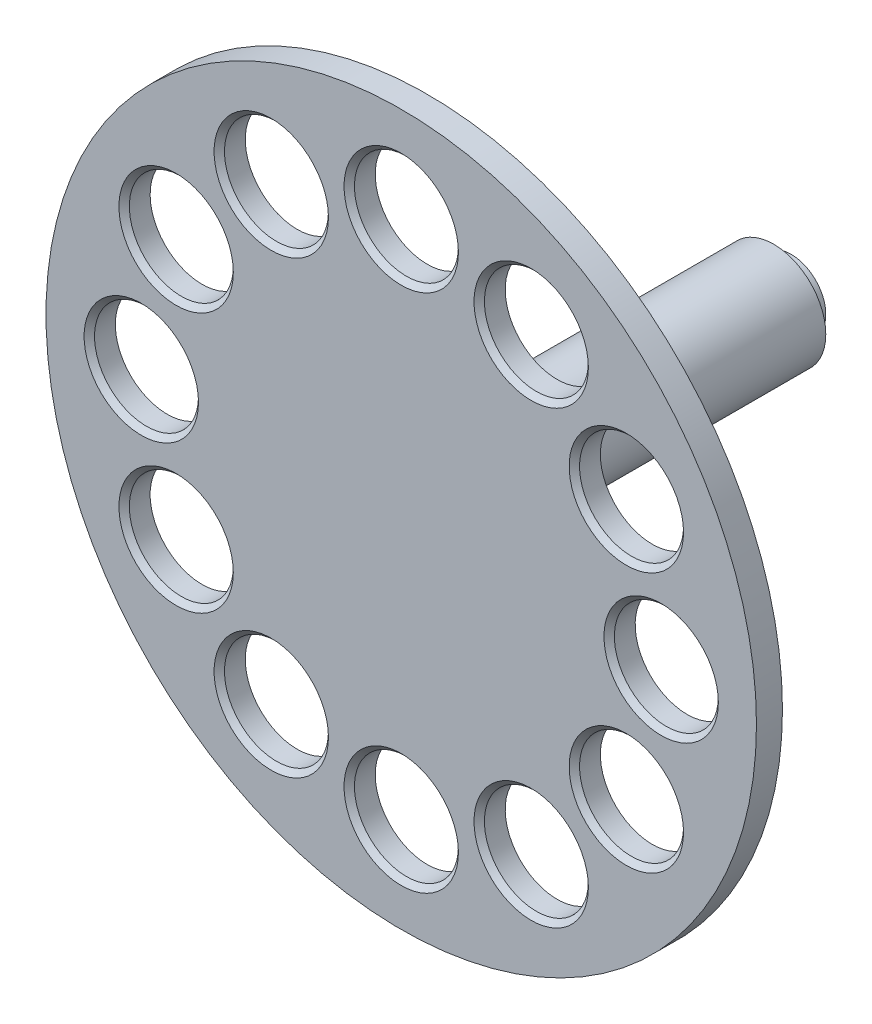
ISO-10303-21;
HEADER;
FILE_DESCRIPTION(('STEP AP214'),'2;1');
FILE_NAME('part.step','',(''),(''),'','','');
FILE_SCHEMA(('AUTOMOTIVE_DESIGN { 1 0 10303 214 1 1 1 1 }'));
ENDSEC;
DATA;
#1=APPLICATION_CONTEXT('core data for automotive mechanical design processes');
#2=APPLICATION_PROTOCOL_DEFINITION('international standard','automotive_design',2000,#1);
#3=PRODUCT_CONTEXT('',#1,'mechanical');
#4=PRODUCT('Part','Part','',(#3));
#5=PRODUCT_RELATED_PRODUCT_CATEGORY('part','',(#4));
#6=PRODUCT_DEFINITION_FORMATION('','',#4);
#7=PRODUCT_DEFINITION_CONTEXT('part definition',#1,'design');
#8=PRODUCT_DEFINITION('design','',#6,#7);
#9=PRODUCT_DEFINITION_SHAPE('','',#8);
#10=(LENGTH_UNIT() NAMED_UNIT(*) SI_UNIT(.MILLI.,.METRE.));
#11=(NAMED_UNIT(*) PLANE_ANGLE_UNIT() SI_UNIT($,.RADIAN.));
#12=(NAMED_UNIT(*) SI_UNIT($,.STERADIAN.) SOLID_ANGLE_UNIT());
#13=UNCERTAINTY_MEASURE_WITH_UNIT(LENGTH_MEASURE(1.E-05),#10,'distance_accuracy_value','');
#14=(GEOMETRIC_REPRESENTATION_CONTEXT(3) GLOBAL_UNCERTAINTY_ASSIGNED_CONTEXT((#13)) GLOBAL_UNIT_ASSIGNED_CONTEXT((#10,
#11,#12)) REPRESENTATION_CONTEXT('',''));
#15=CARTESIAN_POINT('',(0.,0.,0.));
#16=DIRECTION('',(0.,0.,1.));
#17=DIRECTION('',(1.,0.,0.));
#18=AXIS2_PLACEMENT_3D('',#15,#16,#17);
#19=CARTESIAN_POINT('',(0.,0.,-200.));
#20=DIRECTION('',(0.,0.,-1.));
#21=DIRECTION('',(-1.,0.,0.));
#22=AXIS2_PLACEMENT_3D('',#19,#20,#21);
#23=PLANE('',#22);
#24=CARTESIAN_POINT('',(0.,0.,-200.));
#25=DIRECTION('',(0.,0.,-1.));
#26=DIRECTION('',(-1.,0.,0.));
#27=AXIS2_PLACEMENT_3D('',#24,#25,#26);
#28=CIRCLE('',#27,30.);
#29=CARTESIAN_POINT('',(-30.,0.,-200.));
#30=VERTEX_POINT('',#29);
#31=EDGE_CURVE('E152',#30,#30,#28,.T.);
#32=ORIENTED_EDGE('',*,*,#31,.T.);
#33=EDGE_LOOP('',(#32));
#34=FACE_BOUND('',#33,.T.);
#35=CARTESIAN_POINT('',(0.,0.,-200.));
#36=DIRECTION('',(0.,0.,-1.));
#37=DIRECTION('',(-1.,0.,0.));
#38=AXIS2_PLACEMENT_3D('',#35,#36,#37);
#39=CIRCLE('',#38,20.);
#40=CARTESIAN_POINT('',(-20.,0.,-200.));
#41=VERTEX_POINT('',#40);
#42=EDGE_CURVE('E158',#41,#41,#39,.T.);
#43=ORIENTED_EDGE('',*,*,#42,.F.);
#44=EDGE_LOOP('',(#43));
#45=FACE_BOUND('',#44,.T.);
#46=ADVANCED_FACE('F26',(#34,#45),#23,.T.);
#47=CARTESIAN_POINT('',(0.,0.,0.));
#48=DIRECTION('',(0.,0.,1.));
#49=DIRECTION('',(1.,0.,0.));
#50=AXIS2_PLACEMENT_3D('',#47,#48,#49);
#51=PLANE('',#50);
#52=CARTESIAN_POINT('',(0.,0.,0.));
#53=DIRECTION('',(0.,0.,1.));
#54=DIRECTION('',(1.,0.,0.));
#55=AXIS2_PLACEMENT_3D('',#52,#53,#54);
#56=CIRCLE('',#55,205.);
#57=CARTESIAN_POINT('',(205.,0.,0.));
#58=VERTEX_POINT('',#57);
#59=EDGE_CURVE('E113',#58,#58,#56,.T.);
#60=ORIENTED_EDGE('',*,*,#59,.F.);
#61=EDGE_LOOP('',(#60));
#62=FACE_BOUND('',#61,.T.);
#63=CARTESIAN_POINT('',(0.,150.,0.));
#64=DIRECTION('',(0.,0.,1.));
#65=DIRECTION('',(1.,0.,0.));
#66=AXIS2_PLACEMENT_3D('',#63,#64,#65);
#67=CIRCLE('',#66,30.);
#68=CARTESIAN_POINT('',(30.,150.,0.));
#69=VERTEX_POINT('',#68);
#70=EDGE_CURVE('E116',#69,#69,#67,.T.);
#71=ORIENTED_EDGE('',*,*,#70,.T.);
#72=EDGE_LOOP('',(#71));
#73=FACE_BOUND('',#72,.T.);
#74=CARTESIAN_POINT('',(75.0000000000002,129.903810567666,0.));
#75=DIRECTION('',(0.,0.,1.));
#76=DIRECTION('',(0.866025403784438,-0.500000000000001,0.));
#77=AXIS2_PLACEMENT_3D('',#74,#75,#76);
#78=CIRCLE('',#77,30.);
#79=CARTESIAN_POINT('',(100.980762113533,114.903810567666,0.));
#80=VERTEX_POINT('',#79);
#81=EDGE_CURVE('E119',#80,#80,#78,.T.);
#82=ORIENTED_EDGE('',*,*,#81,.T.);
#83=EDGE_LOOP('',(#82));
#84=FACE_BOUND('',#83,.T.);
#85=CARTESIAN_POINT('',(129.903810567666,74.9999999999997,0.));
#86=DIRECTION('',(0.,0.,1.));
#87=DIRECTION('',(0.499999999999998,-0.86602540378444,0.));
#88=AXIS2_PLACEMENT_3D('',#85,#86,#87);
#89=CIRCLE('',#88,30.);
#90=CARTESIAN_POINT('',(144.903810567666,49.0192378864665,0.));
#91=VERTEX_POINT('',#90);
#92=EDGE_CURVE('E122',#91,#91,#89,.T.);
#93=ORIENTED_EDGE('',*,*,#92,.T.);
#94=EDGE_LOOP('',(#93));
#95=FACE_BOUND('',#94,.T.);
#96=CARTESIAN_POINT('',(150.,-5.23722504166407E-13,0.));
#97=DIRECTION('',(0.,0.,1.));
#98=DIRECTION('',(0.,-1.,0.));
#99=AXIS2_PLACEMENT_3D('',#96,#97,#98);
#100=CIRCLE('',#99,30.);
#101=CARTESIAN_POINT('',(150.,-30.0000000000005,0.));
#102=VERTEX_POINT('',#101);
#103=EDGE_CURVE('E125',#102,#102,#100,.T.);
#104=ORIENTED_EDGE('',*,*,#103,.T.);
#105=EDGE_LOOP('',(#104));
#106=FACE_BOUND('',#105,.T.);
#107=CARTESIAN_POINT('',(129.903810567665,-75.0000000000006,0.));
#108=DIRECTION('',(0.,0.,1.));
#109=DIRECTION('',(-0.500000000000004,-0.866025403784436,0.));
#110=AXIS2_PLACEMENT_3D('',#107,#108,#109);
#111=CIRCLE('',#110,30.);
#112=CARTESIAN_POINT('',(114.903810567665,-100.980762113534,0.));
#113=VERTEX_POINT('',#112);
#114=EDGE_CURVE('E128',#113,#113,#111,.T.);
#115=ORIENTED_EDGE('',*,*,#114,.T.);
#116=EDGE_LOOP('',(#115));
#117=FACE_BOUND('',#116,.T.);
#118=CARTESIAN_POINT('',(74.9999999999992,-129.903810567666,0.));
#119=DIRECTION('',(0.,0.,1.));
#120=DIRECTION('',(-0.866025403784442,-0.499999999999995,0.));
#121=AXIS2_PLACEMENT_3D('',#118,#119,#120);
#122=CIRCLE('',#121,30.);
#123=CARTESIAN_POINT('',(49.019237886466,-144.903810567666,0.));
#124=VERTEX_POINT('',#123);
#125=EDGE_CURVE('E131',#124,#124,#122,.T.);
#126=ORIENTED_EDGE('',*,*,#125,.T.);
#127=EDGE_LOOP('',(#126));
#128=FACE_BOUND('',#127,.T.);
#129=CARTESIAN_POINT('',(-1.04744500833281E-12,-150.,0.));
#130=DIRECTION('',(0.,0.,1.));
#131=DIRECTION('',(-1.,0.,0.));
#132=AXIS2_PLACEMENT_3D('',#129,#130,#131);
#133=CIRCLE('',#132,30.);
#134=CARTESIAN_POINT('',(-30.000000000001,-150.,0.));
#135=VERTEX_POINT('',#134);
#136=EDGE_CURVE('E134',#135,#135,#133,.T.);
#137=ORIENTED_EDGE('',*,*,#136,.T.);
#138=EDGE_LOOP('',(#137));
#139=FACE_BOUND('',#138,.T.);
#140=CARTESIAN_POINT('',(-75.0000000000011,-129.903810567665,0.));
#141=DIRECTION('',(0.,0.,1.));
#142=DIRECTION('',(-0.866025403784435,0.500000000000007,0.));
#143=AXIS2_PLACEMENT_3D('',#140,#141,#142);
#144=CIRCLE('',#143,30.);
#145=CARTESIAN_POINT('',(-100.980762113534,-114.903810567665,0.));
#146=VERTEX_POINT('',#145);
#147=EDGE_CURVE('E137',#146,#146,#144,.T.);
#148=ORIENTED_EDGE('',*,*,#147,.T.);
#149=EDGE_LOOP('',(#148));
#150=FACE_BOUND('',#149,.T.);
#151=CARTESIAN_POINT('',(-129.903810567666,-74.9999999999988,0.));
#152=DIRECTION('',(0.,0.,1.));
#153=DIRECTION('',(-0.499999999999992,0.866025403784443,0.));
#154=AXIS2_PLACEMENT_3D('',#151,#152,#153);
#155=CIRCLE('',#154,30.);
#156=CARTESIAN_POINT('',(-144.903810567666,-49.0192378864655,0.));
#157=VERTEX_POINT('',#156);
#158=EDGE_CURVE('E140',#157,#157,#155,.T.);
#159=ORIENTED_EDGE('',*,*,#158,.T.);
#160=EDGE_LOOP('',(#159));
#161=FACE_BOUND('',#160,.T.);
#162=CARTESIAN_POINT('',(-150.,1.57116751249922E-12,0.));
#163=DIRECTION('',(0.,0.,1.));
#164=DIRECTION('',(0.,1.,0.));
#165=AXIS2_PLACEMENT_3D('',#162,#163,#164);
#166=CIRCLE('',#165,30.);
#167=CARTESIAN_POINT('',(-150.,30.0000000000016,0.));
#168=VERTEX_POINT('',#167);
#169=EDGE_CURVE('E143',#168,#168,#166,.T.);
#170=ORIENTED_EDGE('',*,*,#169,.T.);
#171=EDGE_LOOP('',(#170));
#172=FACE_BOUND('',#171,.T.);
#173=CARTESIAN_POINT('',(-129.903810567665,75.0000000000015,0.));
#174=DIRECTION('',(0.,0.,1.));
#175=DIRECTION('',(0.50000000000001,0.866025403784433,0.));
#176=AXIS2_PLACEMENT_3D('',#173,#174,#175);
#177=CIRCLE('',#176,30.);
#178=CARTESIAN_POINT('',(-114.903810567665,100.980762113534,0.));
#179=VERTEX_POINT('',#178);
#180=EDGE_CURVE('E146',#179,#179,#177,.T.);
#181=ORIENTED_EDGE('',*,*,#180,.T.);
#182=EDGE_LOOP('',(#181));
#183=FACE_BOUND('',#182,.T.);
#184=CARTESIAN_POINT('',(-74.9999999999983,129.903810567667,0.));
#185=DIRECTION('',(0.,0.,1.));
#186=DIRECTION('',(0.866025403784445,0.499999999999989,0.));
#187=AXIS2_PLACEMENT_3D('',#184,#185,#186);
#188=CIRCLE('',#187,30.);
#189=CARTESIAN_POINT('',(-49.019237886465,144.903810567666,0.));
#190=VERTEX_POINT('',#189);
#191=EDGE_CURVE('E149',#190,#190,#188,.T.);
#192=ORIENTED_EDGE('',*,*,#191,.T.);
#193=EDGE_LOOP('',(#192));
#194=FACE_BOUND('',#193,.T.);
#195=CARTESIAN_POINT('',(0.,0.,0.));
#196=DIRECTION('',(0.,0.,1.));
#197=DIRECTION('',(1.,0.,0.));
#198=AXIS2_PLACEMENT_3D('',#195,#196,#197);
#199=CIRCLE('',#198,30.);
#200=CARTESIAN_POINT('',(30.,0.,0.));
#201=VERTEX_POINT('',#200);
#202=EDGE_CURVE('E10',#201,#201,#199,.F.);
#203=ORIENTED_EDGE('',*,*,#202,.F.);
#204=EDGE_LOOP('',(#203));
#205=FACE_BOUND('',#204,.T.);
#206=ADVANCED_FACE('F165',(#62,#73,#84,#95,#106,#117,#128,#139,#150,#161,#172,#183,#194,#205),
#51,.F.);
#207=CARTESIAN_POINT('',(0.,0.,15.));
#208=DIRECTION('',(0.,0.,-1.));
#209=DIRECTION('',(-1.,0.,0.));
#210=AXIS2_PLACEMENT_3D('',#207,#208,#209);
#211=CYLINDRICAL_SURFACE('',#210,205.);
#212=CARTESIAN_POINT('',(0.,0.,15.));
#213=DIRECTION('',(0.,0.,1.));
#214=DIRECTION('',(1.,0.,0.));
#215=AXIS2_PLACEMENT_3D('',#212,#213,#214);
#216=CIRCLE('',#215,205.);
#217=CARTESIAN_POINT('',(205.,0.,15.));
#218=VERTEX_POINT('',#217);
#219=EDGE_CURVE('E110',#218,#218,#216,.T.);
#220=ORIENTED_EDGE('',*,*,#219,.F.);
#221=EDGE_LOOP('',(#220));
#222=FACE_BOUND('',#221,.T.);
#223=ORIENTED_EDGE('',*,*,#59,.T.);
#224=EDGE_LOOP('',(#223));
#225=FACE_BOUND('',#224,.T.);
#226=ADVANCED_FACE('F28',(#222,#225),#211,.T.);
#227=CARTESIAN_POINT('',(0.,0.,15.));
#228=DIRECTION('',(0.,0.,1.));
#229=DIRECTION('',(1.,0.,0.));
#230=AXIS2_PLACEMENT_3D('',#227,#228,#229);
#231=PLANE('',#230);
#232=CARTESIAN_POINT('',(-74.9999999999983,129.903810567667,15.));
#233=DIRECTION('',(0.,0.,1.));
#234=DIRECTION('',(1.,0.,0.));
#235=AXIS2_PLACEMENT_3D('',#232,#233,#234);
#236=CIRCLE('',#235,33.);
#237=CARTESIAN_POINT('',(-41.9999999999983,129.903810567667,15.));
#238=VERTEX_POINT('',#237);
#239=EDGE_CURVE('E33',#238,#238,#236,.F.);
#240=ORIENTED_EDGE('',*,*,#239,.T.);
#241=EDGE_LOOP('',(#240));
#242=FACE_BOUND('',#241,.T.);
#243=CARTESIAN_POINT('',(-129.903810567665,75.0000000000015,15.));
#244=DIRECTION('',(0.,0.,1.));
#245=DIRECTION('',(1.,0.,0.));
#246=AXIS2_PLACEMENT_3D('',#243,#244,#245);
#247=CIRCLE('',#246,33.);
#248=CARTESIAN_POINT('',(-96.9038105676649,75.0000000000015,15.));
#249=VERTEX_POINT('',#248);
#250=EDGE_CURVE('E41',#249,#249,#247,.F.);
#251=ORIENTED_EDGE('',*,*,#250,.T.);
#252=EDGE_LOOP('',(#251));
#253=FACE_BOUND('',#252,.T.);
#254=CARTESIAN_POINT('',(-150.,1.57116751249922E-12,15.));
#255=DIRECTION('',(0.,0.,1.));
#256=DIRECTION('',(1.,0.,0.));
#257=AXIS2_PLACEMENT_3D('',#254,#255,#256);
#258=CIRCLE('',#257,33.);
#259=CARTESIAN_POINT('',(-117.,1.57116751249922E-12,15.));
#260=VERTEX_POINT('',#259);
#261=EDGE_CURVE('E49',#260,#260,#258,.F.);
#262=ORIENTED_EDGE('',*,*,#261,.T.);
#263=EDGE_LOOP('',(#262));
#264=FACE_BOUND('',#263,.T.);
#265=CARTESIAN_POINT('',(-129.903810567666,-74.9999999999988,15.));
#266=DIRECTION('',(0.,0.,1.));
#267=DIRECTION('',(1.,0.,0.));
#268=AXIS2_PLACEMENT_3D('',#265,#266,#267);
#269=CIRCLE('',#268,33.);
#270=CARTESIAN_POINT('',(-96.9038105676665,-74.9999999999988,15.));
#271=VERTEX_POINT('',#270);
#272=EDGE_CURVE('E55',#271,#271,#269,.F.);
#273=ORIENTED_EDGE('',*,*,#272,.T.);
#274=EDGE_LOOP('',(#273));
#275=FACE_BOUND('',#274,.T.);
#276=CARTESIAN_POINT('',(-75.0000000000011,-129.903810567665,15.));
#277=DIRECTION('',(0.,0.,1.));
#278=DIRECTION('',(1.,0.,0.));
#279=AXIS2_PLACEMENT_3D('',#276,#277,#278);
#280=CIRCLE('',#279,33.);
#281=CARTESIAN_POINT('',(-42.0000000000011,-129.903810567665,15.));
#282=VERTEX_POINT('',#281);
#283=EDGE_CURVE('E61',#282,#282,#280,.F.);
#284=ORIENTED_EDGE('',*,*,#283,.T.);
#285=EDGE_LOOP('',(#284));
#286=FACE_BOUND('',#285,.T.);
#287=CARTESIAN_POINT('',(-1.04744500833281E-12,-150.,15.));
#288=DIRECTION('',(0.,0.,1.));
#289=DIRECTION('',(1.,0.,0.));
#290=AXIS2_PLACEMENT_3D('',#287,#288,#289);
#291=CIRCLE('',#290,33.);
#292=CARTESIAN_POINT('',(32.999999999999,-150.,15.));
#293=VERTEX_POINT('',#292);
#294=EDGE_CURVE('E67',#293,#293,#291,.F.);
#295=ORIENTED_EDGE('',*,*,#294,.T.);
#296=EDGE_LOOP('',(#295));
#297=FACE_BOUND('',#296,.T.);
#298=CARTESIAN_POINT('',(74.9999999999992,-129.903810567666,15.));
#299=DIRECTION('',(0.,0.,1.));
#300=DIRECTION('',(1.,0.,0.));
#301=AXIS2_PLACEMENT_3D('',#298,#299,#300);
#302=CIRCLE('',#301,33.);
#303=CARTESIAN_POINT('',(107.999999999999,-129.903810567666,15.));
#304=VERTEX_POINT('',#303);
#305=EDGE_CURVE('E73',#304,#304,#302,.F.);
#306=ORIENTED_EDGE('',*,*,#305,.T.);
#307=EDGE_LOOP('',(#306));
#308=FACE_BOUND('',#307,.T.);
#309=CARTESIAN_POINT('',(129.903810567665,-75.0000000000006,15.));
#310=DIRECTION('',(0.,0.,1.));
#311=DIRECTION('',(1.,0.,0.));
#312=AXIS2_PLACEMENT_3D('',#309,#310,#311);
#313=CIRCLE('',#312,33.);
#314=CARTESIAN_POINT('',(162.903810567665,-75.0000000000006,15.));
#315=VERTEX_POINT('',#314);
#316=EDGE_CURVE('E79',#315,#315,#313,.F.);
#317=ORIENTED_EDGE('',*,*,#316,.T.);
#318=EDGE_LOOP('',(#317));
#319=FACE_BOUND('',#318,.T.);
#320=CARTESIAN_POINT('',(150.,-5.23722504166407E-13,15.));
#321=DIRECTION('',(0.,0.,1.));
#322=DIRECTION('',(1.,0.,0.));
#323=AXIS2_PLACEMENT_3D('',#320,#321,#322);
#324=CIRCLE('',#323,33.);
#325=CARTESIAN_POINT('',(183.,-5.23722504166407E-13,15.));
#326=VERTEX_POINT('',#325);
#327=EDGE_CURVE('E85',#326,#326,#324,.F.);
#328=ORIENTED_EDGE('',*,*,#327,.T.);
#329=EDGE_LOOP('',(#328));
#330=FACE_BOUND('',#329,.T.);
#331=CARTESIAN_POINT('',(129.903810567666,74.9999999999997,15.));
#332=DIRECTION('',(0.,0.,1.));
#333=DIRECTION('',(1.,0.,0.));
#334=AXIS2_PLACEMENT_3D('',#331,#332,#333);
#335=CIRCLE('',#334,33.);
#336=CARTESIAN_POINT('',(162.903810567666,74.9999999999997,15.));
#337=VERTEX_POINT('',#336);
#338=EDGE_CURVE('E91',#337,#337,#335,.F.);
#339=ORIENTED_EDGE('',*,*,#338,.T.);
#340=EDGE_LOOP('',(#339));
#341=FACE_BOUND('',#340,.T.);
#342=CARTESIAN_POINT('',(75.0000000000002,129.903810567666,15.));
#343=DIRECTION('',(0.,0.,1.));
#344=DIRECTION('',(1.,0.,0.));
#345=AXIS2_PLACEMENT_3D('',#342,#343,#344);
#346=CIRCLE('',#345,33.);
#347=CARTESIAN_POINT('',(108.,129.903810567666,15.));
#348=VERTEX_POINT('',#347);
#349=EDGE_CURVE('E97',#348,#348,#346,.F.);
#350=ORIENTED_EDGE('',*,*,#349,.T.);
#351=EDGE_LOOP('',(#350));
#352=FACE_BOUND('',#351,.T.);
#353=CARTESIAN_POINT('',(0.,150.,15.));
#354=DIRECTION('',(0.,0.,1.));
#355=DIRECTION('',(1.,0.,0.));
#356=AXIS2_PLACEMENT_3D('',#353,#354,#355);
#357=CIRCLE('',#356,33.);
#358=CARTESIAN_POINT('',(33.,150.,15.));
#359=VERTEX_POINT('',#358);
#360=EDGE_CURVE('E104',#359,#359,#357,.F.);
#361=ORIENTED_EDGE('',*,*,#360,.T.);
#362=EDGE_LOOP('',(#361));
#363=FACE_BOUND('',#362,.T.);
#364=ORIENTED_EDGE('',*,*,#219,.T.);
#365=EDGE_LOOP('',(#364));
#366=FACE_BOUND('',#365,.T.);
#367=ADVANCED_FACE('F274',(#242,#253,#264,#275,#286,#297,#308,#319,#330,#341,#352,#363,#366),
#231,.T.);
#368=CARTESIAN_POINT('',(0.,150.,0.));
#369=DIRECTION('',(0.,0.,1.));
#370=DIRECTION('',(1.,0.,0.));
#371=AXIS2_PLACEMENT_3D('',#368,#369,#370);
#372=CYLINDRICAL_SURFACE('',#371,30.);
#373=CARTESIAN_POINT('',(0.,150.,12.));
#374=DIRECTION('',(0.,0.,1.));
#375=DIRECTION('',(1.,0.,0.));
#376=AXIS2_PLACEMENT_3D('',#373,#374,#375);
#377=CIRCLE('',#376,30.);
#378=CARTESIAN_POINT('',(30.,150.,12.));
#379=VERTEX_POINT('',#378);
#380=EDGE_CURVE('E107',#379,#379,#377,.T.);
#381=ORIENTED_EDGE('',*,*,#380,.T.);
#382=EDGE_LOOP('',(#381));
#383=FACE_BOUND('',#382,.T.);
#384=ORIENTED_EDGE('',*,*,#70,.F.);
#385=EDGE_LOOP('',(#384));
#386=FACE_BOUND('',#385,.T.);
#387=ADVANCED_FACE('F271',(#383,#386),#372,.F.);
#388=CARTESIAN_POINT('',(0.,150.,12.));
#389=DIRECTION('',(0.,0.,1.));
#390=DIRECTION('',(1.,0.,0.));
#391=AXIS2_PLACEMENT_3D('',#388,#389,#390);
#392=CONICAL_SURFACE('',#391,30.,0.78539816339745);
#393=ORIENTED_EDGE('',*,*,#360,.F.);
#394=EDGE_LOOP('',(#393));
#395=FACE_BOUND('',#394,.T.);
#396=ORIENTED_EDGE('',*,*,#380,.F.);
#397=EDGE_LOOP('',(#396));
#398=FACE_BOUND('',#397,.T.);
#399=ADVANCED_FACE('F267',(#395,#398),#392,.F.);
#400=CARTESIAN_POINT('',(75.0000000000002,129.903810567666,0.));
#401=DIRECTION('',(0.,0.,1.));
#402=DIRECTION('',(1.,0.,0.));
#403=AXIS2_PLACEMENT_3D('',#400,#401,#402);
#404=CYLINDRICAL_SURFACE('',#403,30.);
#405=CARTESIAN_POINT('',(75.0000000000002,129.903810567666,12.));
#406=DIRECTION('',(0.,0.,1.));
#407=DIRECTION('',(1.,0.,0.));
#408=AXIS2_PLACEMENT_3D('',#405,#406,#407);
#409=CIRCLE('',#408,30.);
#410=CARTESIAN_POINT('',(105.,129.903810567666,12.));
#411=VERTEX_POINT('',#410);
#412=EDGE_CURVE('E101',#411,#411,#409,.T.);
#413=ORIENTED_EDGE('',*,*,#412,.T.);
#414=EDGE_LOOP('',(#413));
#415=FACE_BOUND('',#414,.T.);
#416=ORIENTED_EDGE('',*,*,#81,.F.);
#417=EDGE_LOOP('',(#416));
#418=FACE_BOUND('',#417,.T.);
#419=ADVANCED_FACE('F263',(#415,#418),#404,.F.);
#420=CARTESIAN_POINT('',(129.903810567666,74.9999999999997,0.));
#421=DIRECTION('',(0.,0.,1.));
#422=DIRECTION('',(1.,0.,0.));
#423=AXIS2_PLACEMENT_3D('',#420,#421,#422);
#424=CYLINDRICAL_SURFACE('',#423,30.);
#425=CARTESIAN_POINT('',(129.903810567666,74.9999999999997,12.));
#426=DIRECTION('',(0.,0.,1.));
#427=DIRECTION('',(1.,0.,0.));
#428=AXIS2_PLACEMENT_3D('',#425,#426,#427);
#429=CIRCLE('',#428,30.);
#430=CARTESIAN_POINT('',(159.903810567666,74.9999999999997,12.));
#431=VERTEX_POINT('',#430);
#432=EDGE_CURVE('E94',#431,#431,#429,.T.);
#433=ORIENTED_EDGE('',*,*,#432,.T.);
#434=EDGE_LOOP('',(#433));
#435=FACE_BOUND('',#434,.T.);
#436=ORIENTED_EDGE('',*,*,#92,.F.);
#437=EDGE_LOOP('',(#436));
#438=FACE_BOUND('',#437,.T.);
#439=ADVANCED_FACE('F259',(#435,#438),#424,.F.);
#440=CARTESIAN_POINT('',(150.,-5.23722504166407E-13,0.));
#441=DIRECTION('',(0.,0.,1.));
#442=DIRECTION('',(1.,0.,0.));
#443=AXIS2_PLACEMENT_3D('',#440,#441,#442);
#444=CYLINDRICAL_SURFACE('',#443,30.);
#445=CARTESIAN_POINT('',(150.,-5.23722504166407E-13,12.));
#446=DIRECTION('',(0.,0.,1.));
#447=DIRECTION('',(1.,0.,0.));
#448=AXIS2_PLACEMENT_3D('',#445,#446,#447);
#449=CIRCLE('',#448,30.);
#450=CARTESIAN_POINT('',(180.,-5.23722504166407E-13,12.));
#451=VERTEX_POINT('',#450);
#452=EDGE_CURVE('E88',#451,#451,#449,.T.);
#453=ORIENTED_EDGE('',*,*,#452,.T.);
#454=EDGE_LOOP('',(#453));
#455=FACE_BOUND('',#454,.T.);
#456=ORIENTED_EDGE('',*,*,#103,.F.);
#457=EDGE_LOOP('',(#456));
#458=FACE_BOUND('',#457,.T.);
#459=ADVANCED_FACE('F255',(#455,#458),#444,.F.);
#460=CARTESIAN_POINT('',(129.903810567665,-75.0000000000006,0.));
#461=DIRECTION('',(0.,0.,1.));
#462=DIRECTION('',(1.,0.,0.));
#463=AXIS2_PLACEMENT_3D('',#460,#461,#462);
#464=CYLINDRICAL_SURFACE('',#463,30.);
#465=CARTESIAN_POINT('',(129.903810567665,-75.0000000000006,12.));
#466=DIRECTION('',(0.,0.,1.));
#467=DIRECTION('',(1.,0.,0.));
#468=AXIS2_PLACEMENT_3D('',#465,#466,#467);
#469=CIRCLE('',#468,30.);
#470=CARTESIAN_POINT('',(159.903810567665,-75.0000000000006,12.));
#471=VERTEX_POINT('',#470);
#472=EDGE_CURVE('E82',#471,#471,#469,.T.);
#473=ORIENTED_EDGE('',*,*,#472,.T.);
#474=EDGE_LOOP('',(#473));
#475=FACE_BOUND('',#474,.T.);
#476=ORIENTED_EDGE('',*,*,#114,.F.);
#477=EDGE_LOOP('',(#476));
#478=FACE_BOUND('',#477,.T.);
#479=ADVANCED_FACE('F251',(#475,#478),#464,.F.);
#480=CARTESIAN_POINT('',(74.9999999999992,-129.903810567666,0.));
#481=DIRECTION('',(0.,0.,1.));
#482=DIRECTION('',(1.,0.,0.));
#483=AXIS2_PLACEMENT_3D('',#480,#481,#482);
#484=CYLINDRICAL_SURFACE('',#483,30.);
#485=CARTESIAN_POINT('',(74.9999999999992,-129.903810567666,12.));
#486=DIRECTION('',(0.,0.,1.));
#487=DIRECTION('',(1.,0.,0.));
#488=AXIS2_PLACEMENT_3D('',#485,#486,#487);
#489=CIRCLE('',#488,30.);
#490=CARTESIAN_POINT('',(104.999999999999,-129.903810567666,12.));
#491=VERTEX_POINT('',#490);
#492=EDGE_CURVE('E76',#491,#491,#489,.T.);
#493=ORIENTED_EDGE('',*,*,#492,.T.);
#494=EDGE_LOOP('',(#493));
#495=FACE_BOUND('',#494,.T.);
#496=ORIENTED_EDGE('',*,*,#125,.F.);
#497=EDGE_LOOP('',(#496));
#498=FACE_BOUND('',#497,.T.);
#499=ADVANCED_FACE('F247',(#495,#498),#484,.F.);
#500=CARTESIAN_POINT('',(-1.04744500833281E-12,-150.,0.));
#501=DIRECTION('',(0.,0.,1.));
#502=DIRECTION('',(1.,0.,0.));
#503=AXIS2_PLACEMENT_3D('',#500,#501,#502);
#504=CYLINDRICAL_SURFACE('',#503,30.);
#505=CARTESIAN_POINT('',(-1.04744500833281E-12,-150.,12.));
#506=DIRECTION('',(0.,0.,1.));
#507=DIRECTION('',(1.,0.,0.));
#508=AXIS2_PLACEMENT_3D('',#505,#506,#507);
#509=CIRCLE('',#508,30.);
#510=CARTESIAN_POINT('',(29.999999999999,-150.,12.));
#511=VERTEX_POINT('',#510);
#512=EDGE_CURVE('E70',#511,#511,#509,.T.);
#513=ORIENTED_EDGE('',*,*,#512,.T.);
#514=EDGE_LOOP('',(#513));
#515=FACE_BOUND('',#514,.T.);
#516=ORIENTED_EDGE('',*,*,#136,.F.);
#517=EDGE_LOOP('',(#516));
#518=FACE_BOUND('',#517,.T.);
#519=ADVANCED_FACE('F243',(#515,#518),#504,.F.);
#520=CARTESIAN_POINT('',(-75.0000000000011,-129.903810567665,0.));
#521=DIRECTION('',(0.,0.,1.));
#522=DIRECTION('',(1.,0.,0.));
#523=AXIS2_PLACEMENT_3D('',#520,#521,#522);
#524=CYLINDRICAL_SURFACE('',#523,30.);
#525=CARTESIAN_POINT('',(-75.0000000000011,-129.903810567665,12.));
#526=DIRECTION('',(0.,0.,1.));
#527=DIRECTION('',(1.,0.,0.));
#528=AXIS2_PLACEMENT_3D('',#525,#526,#527);
#529=CIRCLE('',#528,30.);
#530=CARTESIAN_POINT('',(-45.0000000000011,-129.903810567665,12.));
#531=VERTEX_POINT('',#530);
#532=EDGE_CURVE('E64',#531,#531,#529,.T.);
#533=ORIENTED_EDGE('',*,*,#532,.T.);
#534=EDGE_LOOP('',(#533));
#535=FACE_BOUND('',#534,.T.);
#536=ORIENTED_EDGE('',*,*,#147,.F.);
#537=EDGE_LOOP('',(#536));
#538=FACE_BOUND('',#537,.T.);
#539=ADVANCED_FACE('F239',(#535,#538),#524,.F.);
#540=CARTESIAN_POINT('',(-129.903810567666,-74.9999999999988,0.));
#541=DIRECTION('',(0.,0.,1.));
#542=DIRECTION('',(1.,0.,0.));
#543=AXIS2_PLACEMENT_3D('',#540,#541,#542);
#544=CYLINDRICAL_SURFACE('',#543,30.);
#545=CARTESIAN_POINT('',(-129.903810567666,-74.9999999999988,12.));
#546=DIRECTION('',(0.,0.,1.));
#547=DIRECTION('',(1.,0.,0.));
#548=AXIS2_PLACEMENT_3D('',#545,#546,#547);
#549=CIRCLE('',#548,30.);
#550=CARTESIAN_POINT('',(-99.9038105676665,-74.9999999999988,12.));
#551=VERTEX_POINT('',#550);
#552=EDGE_CURVE('E58',#551,#551,#549,.T.);
#553=ORIENTED_EDGE('',*,*,#552,.T.);
#554=EDGE_LOOP('',(#553));
#555=FACE_BOUND('',#554,.T.);
#556=ORIENTED_EDGE('',*,*,#158,.F.);
#557=EDGE_LOOP('',(#556));
#558=FACE_BOUND('',#557,.T.);
#559=ADVANCED_FACE('F235',(#555,#558),#544,.F.);
#560=CARTESIAN_POINT('',(-150.,1.57116751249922E-12,0.));
#561=DIRECTION('',(0.,0.,1.));
#562=DIRECTION('',(1.,0.,0.));
#563=AXIS2_PLACEMENT_3D('',#560,#561,#562);
#564=CYLINDRICAL_SURFACE('',#563,30.);
#565=CARTESIAN_POINT('',(-150.,1.57116751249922E-12,12.));
#566=DIRECTION('',(0.,0.,1.));
#567=DIRECTION('',(1.,0.,0.));
#568=AXIS2_PLACEMENT_3D('',#565,#566,#567);
#569=CIRCLE('',#568,30.);
#570=CARTESIAN_POINT('',(-120.,1.57116751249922E-12,12.));
#571=VERTEX_POINT('',#570);
#572=EDGE_CURVE('E52',#571,#571,#569,.T.);
#573=ORIENTED_EDGE('',*,*,#572,.T.);
#574=EDGE_LOOP('',(#573));
#575=FACE_BOUND('',#574,.T.);
#576=ORIENTED_EDGE('',*,*,#169,.F.);
#577=EDGE_LOOP('',(#576));
#578=FACE_BOUND('',#577,.T.);
#579=ADVANCED_FACE('F231',(#575,#578),#564,.F.);
#580=CARTESIAN_POINT('',(-129.903810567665,75.0000000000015,0.));
#581=DIRECTION('',(0.,0.,1.));
#582=DIRECTION('',(1.,0.,0.));
#583=AXIS2_PLACEMENT_3D('',#580,#581,#582);
#584=CYLINDRICAL_SURFACE('',#583,30.);
#585=CARTESIAN_POINT('',(-129.903810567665,75.0000000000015,12.));
#586=DIRECTION('',(0.,0.,1.));
#587=DIRECTION('',(1.,0.,0.));
#588=AXIS2_PLACEMENT_3D('',#585,#586,#587);
#589=CIRCLE('',#588,30.);
#590=CARTESIAN_POINT('',(-99.9038105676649,75.0000000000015,12.));
#591=VERTEX_POINT('',#590);
#592=EDGE_CURVE('E46',#591,#591,#589,.T.);
#593=ORIENTED_EDGE('',*,*,#592,.T.);
#594=EDGE_LOOP('',(#593));
#595=FACE_BOUND('',#594,.T.);
#596=ORIENTED_EDGE('',*,*,#180,.F.);
#597=EDGE_LOOP('',(#596));
#598=FACE_BOUND('',#597,.T.);
#599=ADVANCED_FACE('F227',(#595,#598),#584,.F.);
#600=CARTESIAN_POINT('',(-74.9999999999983,129.903810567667,0.));
#601=DIRECTION('',(0.,0.,1.));
#602=DIRECTION('',(1.,0.,0.));
#603=AXIS2_PLACEMENT_3D('',#600,#601,#602);
#604=CYLINDRICAL_SURFACE('',#603,30.);
#605=CARTESIAN_POINT('',(-74.9999999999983,129.903810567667,12.));
#606=DIRECTION('',(0.,0.,1.));
#607=DIRECTION('',(1.,0.,0.));
#608=AXIS2_PLACEMENT_3D('',#605,#606,#607);
#609=CIRCLE('',#608,30.);
#610=CARTESIAN_POINT('',(-44.9999999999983,129.903810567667,12.));
#611=VERTEX_POINT('',#610);
#612=EDGE_CURVE('E37',#611,#611,#609,.T.);
#613=ORIENTED_EDGE('',*,*,#612,.T.);
#614=EDGE_LOOP('',(#613));
#615=FACE_BOUND('',#614,.T.);
#616=ORIENTED_EDGE('',*,*,#191,.F.);
#617=EDGE_LOOP('',(#616));
#618=FACE_BOUND('',#617,.T.);
#619=ADVANCED_FACE('F223',(#615,#618),#604,.F.);
#620=CARTESIAN_POINT('',(75.0000000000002,129.903810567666,12.));
#621=DIRECTION('',(0.,0.,1.));
#622=DIRECTION('',(1.,0.,0.));
#623=AXIS2_PLACEMENT_3D('',#620,#621,#622);
#624=CONICAL_SURFACE('',#623,30.,0.785398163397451);
#625=ORIENTED_EDGE('',*,*,#349,.F.);
#626=EDGE_LOOP('',(#625));
#627=FACE_BOUND('',#626,.T.);
#628=ORIENTED_EDGE('',*,*,#412,.F.);
#629=EDGE_LOOP('',(#628));
#630=FACE_BOUND('',#629,.T.);
#631=ADVANCED_FACE('F219',(#627,#630),#624,.F.);
#632=CARTESIAN_POINT('',(129.903810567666,74.9999999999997,12.));
#633=DIRECTION('',(0.,0.,1.));
#634=DIRECTION('',(1.,0.,0.));
#635=AXIS2_PLACEMENT_3D('',#632,#633,#634);
#636=CONICAL_SURFACE('',#635,30.,0.785398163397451);
#637=ORIENTED_EDGE('',*,*,#338,.F.);
#638=EDGE_LOOP('',(#637));
#639=FACE_BOUND('',#638,.T.);
#640=ORIENTED_EDGE('',*,*,#432,.F.);
#641=EDGE_LOOP('',(#640));
#642=FACE_BOUND('',#641,.T.);
#643=ADVANCED_FACE('F215',(#639,#642),#636,.F.);
#644=CARTESIAN_POINT('',(150.,-5.23722504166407E-13,12.));
#645=DIRECTION('',(0.,0.,1.));
#646=DIRECTION('',(1.,0.,0.));
#647=AXIS2_PLACEMENT_3D('',#644,#645,#646);
#648=CONICAL_SURFACE('',#647,30.,0.78539816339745);
#649=ORIENTED_EDGE('',*,*,#327,.F.);
#650=EDGE_LOOP('',(#649));
#651=FACE_BOUND('',#650,.T.);
#652=ORIENTED_EDGE('',*,*,#452,.F.);
#653=EDGE_LOOP('',(#652));
#654=FACE_BOUND('',#653,.T.);
#655=ADVANCED_FACE('F211',(#651,#654),#648,.F.);
#656=CARTESIAN_POINT('',(129.903810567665,-75.0000000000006,12.));
#657=DIRECTION('',(0.,0.,1.));
#658=DIRECTION('',(1.,0.,0.));
#659=AXIS2_PLACEMENT_3D('',#656,#657,#658);
#660=CONICAL_SURFACE('',#659,30.,0.78539816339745);
#661=ORIENTED_EDGE('',*,*,#316,.F.);
#662=EDGE_LOOP('',(#661));
#663=FACE_BOUND('',#662,.T.);
#664=ORIENTED_EDGE('',*,*,#472,.F.);
#665=EDGE_LOOP('',(#664));
#666=FACE_BOUND('',#665,.T.);
#667=ADVANCED_FACE('F207',(#663,#666),#660,.F.);
#668=CARTESIAN_POINT('',(74.9999999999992,-129.903810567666,12.));
#669=DIRECTION('',(0.,0.,1.));
#670=DIRECTION('',(1.,0.,0.));
#671=AXIS2_PLACEMENT_3D('',#668,#669,#670);
#672=CONICAL_SURFACE('',#671,30.,0.785398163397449);
#673=ORIENTED_EDGE('',*,*,#305,.F.);
#674=EDGE_LOOP('',(#673));
#675=FACE_BOUND('',#674,.T.);
#676=ORIENTED_EDGE('',*,*,#492,.F.);
#677=EDGE_LOOP('',(#676));
#678=FACE_BOUND('',#677,.T.);
#679=ADVANCED_FACE('F203',(#675,#678),#672,.F.);
#680=CARTESIAN_POINT('',(-1.04744500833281E-12,-150.,12.));
#681=DIRECTION('',(0.,0.,1.));
#682=DIRECTION('',(1.,0.,0.));
#683=AXIS2_PLACEMENT_3D('',#680,#681,#682);
#684=CONICAL_SURFACE('',#683,30.,0.785398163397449);
#685=ORIENTED_EDGE('',*,*,#294,.F.);
#686=EDGE_LOOP('',(#685));
#687=FACE_BOUND('',#686,.T.);
#688=ORIENTED_EDGE('',*,*,#512,.F.);
#689=EDGE_LOOP('',(#688));
#690=FACE_BOUND('',#689,.T.);
#691=ADVANCED_FACE('F199',(#687,#690),#684,.F.);
#692=CARTESIAN_POINT('',(-75.0000000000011,-129.903810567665,12.));
#693=DIRECTION('',(0.,0.,1.));
#694=DIRECTION('',(1.,0.,0.));
#695=AXIS2_PLACEMENT_3D('',#692,#693,#694);
#696=CONICAL_SURFACE('',#695,30.,0.78539816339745);
#697=ORIENTED_EDGE('',*,*,#283,.F.);
#698=EDGE_LOOP('',(#697));
#699=FACE_BOUND('',#698,.T.);
#700=ORIENTED_EDGE('',*,*,#532,.F.);
#701=EDGE_LOOP('',(#700));
#702=FACE_BOUND('',#701,.T.);
#703=ADVANCED_FACE('F195',(#699,#702),#696,.F.);
#704=CARTESIAN_POINT('',(-129.903810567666,-74.9999999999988,12.));
#705=DIRECTION('',(0.,0.,1.));
#706=DIRECTION('',(1.,0.,0.));
#707=AXIS2_PLACEMENT_3D('',#704,#705,#706);
#708=CONICAL_SURFACE('',#707,30.,0.785398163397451);
#709=ORIENTED_EDGE('',*,*,#272,.F.);
#710=EDGE_LOOP('',(#709));
#711=FACE_BOUND('',#710,.T.);
#712=ORIENTED_EDGE('',*,*,#552,.F.);
#713=EDGE_LOOP('',(#712));
#714=FACE_BOUND('',#713,.T.);
#715=ADVANCED_FACE('F191',(#711,#714),#708,.F.);
#716=CARTESIAN_POINT('',(-150.,1.57116751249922E-12,12.));
#717=DIRECTION('',(0.,0.,1.));
#718=DIRECTION('',(1.,0.,0.));
#719=AXIS2_PLACEMENT_3D('',#716,#717,#718);
#720=CONICAL_SURFACE('',#719,30.,0.785398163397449);
#721=ORIENTED_EDGE('',*,*,#261,.F.);
#722=EDGE_LOOP('',(#721));
#723=FACE_BOUND('',#722,.T.);
#724=ORIENTED_EDGE('',*,*,#572,.F.);
#725=EDGE_LOOP('',(#724));
#726=FACE_BOUND('',#725,.T.);
#727=ADVANCED_FACE('F187',(#723,#726),#720,.F.);
#728=CARTESIAN_POINT('',(-129.903810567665,75.0000000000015,12.));
#729=DIRECTION('',(0.,0.,1.));
#730=DIRECTION('',(1.,0.,0.));
#731=AXIS2_PLACEMENT_3D('',#728,#729,#730);
#732=CONICAL_SURFACE('',#731,30.,0.785398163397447);
#733=ORIENTED_EDGE('',*,*,#250,.F.);
#734=EDGE_LOOP('',(#733));
#735=FACE_BOUND('',#734,.T.);
#736=ORIENTED_EDGE('',*,*,#592,.F.);
#737=EDGE_LOOP('',(#736));
#738=FACE_BOUND('',#737,.T.);
#739=ADVANCED_FACE('F183',(#735,#738),#732,.F.);
#740=CARTESIAN_POINT('',(-74.9999999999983,129.903810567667,12.));
#741=DIRECTION('',(0.,0.,1.));
#742=DIRECTION('',(1.,0.,0.));
#743=AXIS2_PLACEMENT_3D('',#740,#741,#742);
#744=CONICAL_SURFACE('',#743,30.,0.785398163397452);
#745=ORIENTED_EDGE('',*,*,#239,.F.);
#746=EDGE_LOOP('',(#745));
#747=FACE_BOUND('',#746,.T.);
#748=ORIENTED_EDGE('',*,*,#612,.F.);
#749=EDGE_LOOP('',(#748));
#750=FACE_BOUND('',#749,.T.);
#751=ADVANCED_FACE('F179',(#747,#750),#744,.F.);
#752=CARTESIAN_POINT('',(0.,0.,-200.));
#753=DIRECTION('',(0.,0.,1.));
#754=DIRECTION('',(1.,0.,0.));
#755=AXIS2_PLACEMENT_3D('',#752,#753,#754);
#756=CYLINDRICAL_SURFACE('',#755,30.);
#757=ORIENTED_EDGE('',*,*,#31,.F.);
#758=EDGE_LOOP('',(#757));
#759=FACE_BOUND('',#758,.T.);
#760=ORIENTED_EDGE('',*,*,#202,.T.);
#761=EDGE_LOOP('',(#760));
#762=FACE_BOUND('',#761,.T.);
#763=ADVANCED_FACE('F176',(#759,#762),#756,.T.);
#764=CARTESIAN_POINT('',(0.,0.,-210.));
#765=DIRECTION('',(0.,0.,1.));
#766=DIRECTION('',(1.,0.,0.));
#767=AXIS2_PLACEMENT_3D('',#764,#765,#766);
#768=CYLINDRICAL_SURFACE('',#767,20.);
#769=CARTESIAN_POINT('',(0.,0.,-210.));
#770=DIRECTION('',(0.,0.,-1.));
#771=DIRECTION('',(-1.,0.,0.));
#772=AXIS2_PLACEMENT_3D('',#769,#770,#771);
#773=CIRCLE('',#772,20.);
#774=CARTESIAN_POINT('',(-20.,0.,-210.));
#775=VERTEX_POINT('',#774);
#776=EDGE_CURVE('E155',#775,#775,#773,.T.);
#777=ORIENTED_EDGE('',*,*,#776,.F.);
#778=EDGE_LOOP('',(#777));
#779=FACE_BOUND('',#778,.T.);
#780=ORIENTED_EDGE('',*,*,#42,.T.);
#781=EDGE_LOOP('',(#780));
#782=FACE_BOUND('',#781,.T.);
#783=ADVANCED_FACE('F162',(#779,#782),#768,.T.);
#784=CARTESIAN_POINT('',(0.,0.,-210.));
#785=DIRECTION('',(0.,0.,-1.));
#786=DIRECTION('',(-1.,0.,0.));
#787=AXIS2_PLACEMENT_3D('',#784,#785,#786);
#788=PLANE('',#787);
#789=ORIENTED_EDGE('',*,*,#776,.T.);
#790=EDGE_LOOP('',(#789));
#791=FACE_BOUND('',#790,.T.);
#792=ADVANCED_FACE('F390',(#791),#788,.T.);
#793=CLOSED_SHELL('',(#46,#206,#226,#367,#387,#399,#419,#439,#459,#479,#499,#519,#539,#559,#579,
#599,#619,#631,#643,#655,#667,#679,#691,#703,#715,#727,#739,#751,#763,#783,#792));
#794=MANIFOLD_SOLID_BREP('B2',#793);
#795=ADVANCED_BREP_SHAPE_REPRESENTATION('',(#18,#794),#14);
#796=SHAPE_DEFINITION_REPRESENTATION(#9,#795);
ENDSEC;
END-ISO-10303-21;
